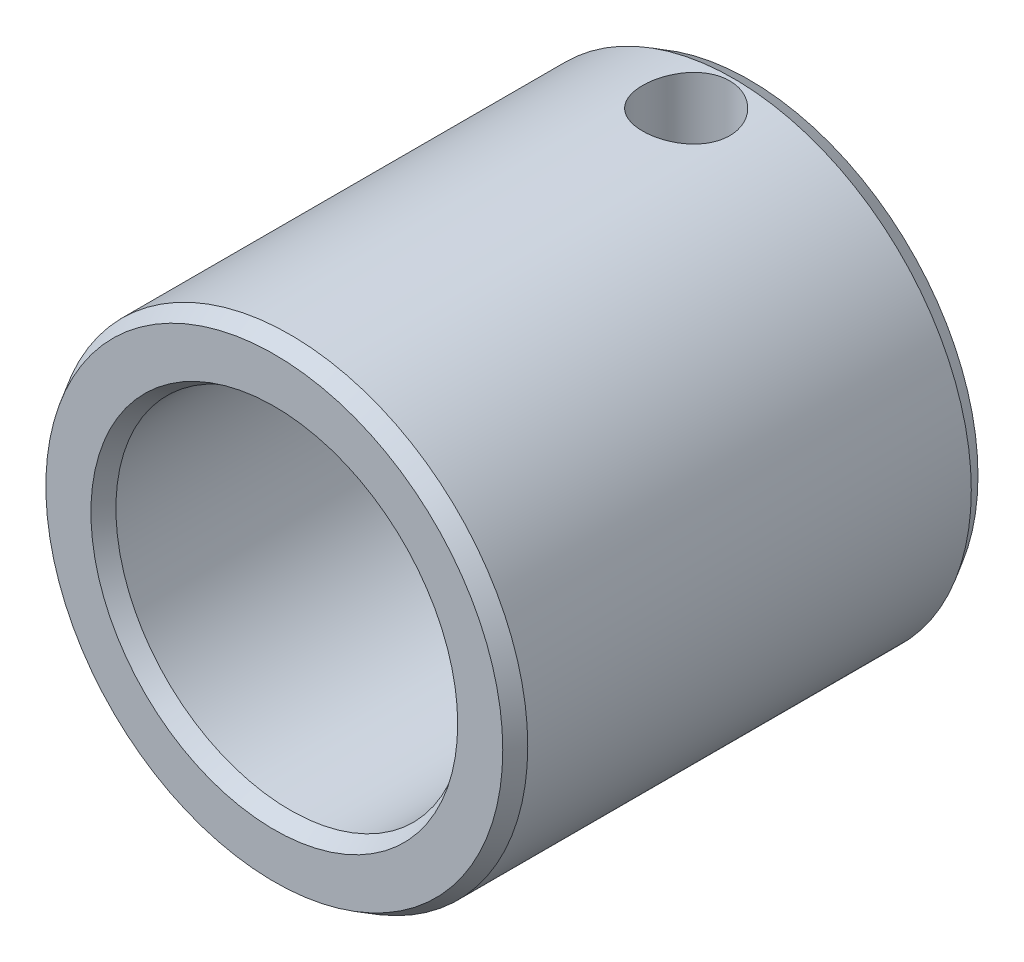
ISO-10303-21;
HEADER;
FILE_DESCRIPTION(('STEP AP214'),'2;1');
FILE_NAME('part.step','',(''),(''),'','','');
FILE_SCHEMA(('AUTOMOTIVE_DESIGN { 1 0 10303 214 1 1 1 1 }'));
ENDSEC;
DATA;
#1=APPLICATION_CONTEXT('core data for automotive mechanical design processes');
#2=APPLICATION_PROTOCOL_DEFINITION('international standard','automotive_design',2000,#1);
#3=PRODUCT_CONTEXT('',#1,'mechanical');
#4=PRODUCT('Part','Part','',(#3));
#5=PRODUCT_RELATED_PRODUCT_CATEGORY('part','',(#4));
#6=PRODUCT_DEFINITION_FORMATION('','',#4);
#7=PRODUCT_DEFINITION_CONTEXT('part definition',#1,'design');
#8=PRODUCT_DEFINITION('design','',#6,#7);
#9=PRODUCT_DEFINITION_SHAPE('','',#8);
#10=(LENGTH_UNIT() NAMED_UNIT(*) SI_UNIT(.MILLI.,.METRE.));
#11=(NAMED_UNIT(*) PLANE_ANGLE_UNIT() SI_UNIT($,.RADIAN.));
#12=(NAMED_UNIT(*) SI_UNIT($,.STERADIAN.) SOLID_ANGLE_UNIT());
#13=UNCERTAINTY_MEASURE_WITH_UNIT(LENGTH_MEASURE(1.E-05),#10,'distance_accuracy_value','');
#14=(GEOMETRIC_REPRESENTATION_CONTEXT(3) GLOBAL_UNCERTAINTY_ASSIGNED_CONTEXT((#13)) GLOBAL_UNIT_ASSIGNED_CONTEXT((#10,
#11,#12)) REPRESENTATION_CONTEXT('',''));
#15=CARTESIAN_POINT('',(0.,0.,0.));
#16=DIRECTION('',(0.,0.,1.));
#17=DIRECTION('',(1.,0.,0.));
#18=AXIS2_PLACEMENT_3D('',#15,#16,#17);
#19=CARTESIAN_POINT('',(0.,0.,36.072301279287));
#20=DIRECTION('',(0.,0.,1.));
#21=DIRECTION('',(1.,0.,0.));
#22=AXIS2_PLACEMENT_3D('',#19,#20,#21);
#23=CYLINDRICAL_SURFACE('',#22,11.);
#24=CARTESIAN_POINT('',(0.,0.,29.));
#25=DIRECTION('',(0.,0.,1.));
#26=DIRECTION('',(1.,0.,0.));
#27=AXIS2_PLACEMENT_3D('',#24,#25,#26);
#28=CIRCLE('',#27,11.);
#29=CARTESIAN_POINT('',(11.,0.,29.));
#30=VERTEX_POINT('',#29);
#31=EDGE_CURVE('E29',#30,#30,#28,.T.);
#32=ORIENTED_EDGE('',*,*,#31,.T.);
#33=EDGE_LOOP('',(#32));
#34=FACE_BOUND('',#33,.T.);
#35=CARTESIAN_POINT('',(0.,0.,1.));
#36=DIRECTION('',(0.,0.,1.));
#37=DIRECTION('',(1.,0.,0.));
#38=AXIS2_PLACEMENT_3D('',#35,#36,#37);
#39=CIRCLE('',#38,11.);
#40=CARTESIAN_POINT('',(11.,0.,1.));
#41=VERTEX_POINT('',#40);
#42=EDGE_CURVE('E34',#41,#41,#39,.T.);
#43=ORIENTED_EDGE('',*,*,#42,.F.);
#44=EDGE_LOOP('',(#43));
#45=FACE_BOUND('',#44,.T.);
#46=CARTESIAN_POINT('',(0.,11.,6.75));
#47=CARTESIAN_POINT('',(0.151939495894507,10.9999974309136,6.74999573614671));
#48=CARTESIAN_POINT('',(0.303926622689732,10.9968205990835,6.73736549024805));
#49=CARTESIAN_POINT('',(0.603544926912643,10.9844554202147,6.68725388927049));
#50=CARTESIAN_POINT('',(0.751173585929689,10.9752636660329,6.64975844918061));
#51=CARTESIAN_POINT('',(1.03770493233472,10.9518864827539,6.55119470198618));
#52=CARTESIAN_POINT('',(1.17661786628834,10.9377070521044,6.49015470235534));
#53=CARTESIAN_POINT('',(1.44223224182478,10.9058646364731,6.34633411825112));
#54=CARTESIAN_POINT('',(1.56893327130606,10.8882015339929,6.26355280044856));
#55=CARTESIAN_POINT('',(1.80913686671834,10.8509025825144,6.07679855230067));
#56=CARTESIAN_POINT('',(1.92235209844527,10.8312362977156,5.97246211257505));
#57=CARTESIAN_POINT('',(2.12987303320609,10.7923497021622,5.74633762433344));
#58=CARTESIAN_POINT('',(2.22417660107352,10.7731294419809,5.62454760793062));
#59=CARTESIAN_POINT('',(2.39254866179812,10.7370042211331,5.36474208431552));
#60=CARTESIAN_POINT('',(2.46629572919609,10.7201378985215,5.226512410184));
#61=CARTESIAN_POINT('',(2.58939433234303,10.6910740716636,4.9391279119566));
#62=CARTESIAN_POINT('',(2.63874976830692,10.6788758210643,4.78997483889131));
#63=CARTESIAN_POINT('',(2.7106838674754,10.6608420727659,4.48813691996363));
#64=CARTESIAN_POINT('',(2.73377915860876,10.6548840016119,4.33558269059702));
#65=CARTESIAN_POINT('',(2.75414658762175,10.6496383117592,4.0286576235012));
#66=CARTESIAN_POINT('',(2.75142292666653,10.6503496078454,3.87428708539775));
#67=CARTESIAN_POINT('',(2.72064196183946,10.6582521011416,3.57207101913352));
#68=CARTESIAN_POINT('',(2.69320029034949,10.6652858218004,3.42415802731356));
#69=CARTESIAN_POINT('',(2.61474434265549,10.6847896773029,3.13510473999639));
#70=CARTESIAN_POINT('',(2.56372838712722,10.697260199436,2.99396492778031));
#71=CARTESIAN_POINT('',(2.43904737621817,10.7263770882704,2.7208136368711));
#72=CARTESIAN_POINT('',(2.36515888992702,10.7430643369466,2.58890868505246));
#73=CARTESIAN_POINT('',(2.1969865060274,10.7787113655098,2.33914903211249));
#74=CARTESIAN_POINT('',(2.10269903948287,10.7976715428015,2.22129679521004));
#75=CARTESIAN_POINT('',(1.89321627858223,10.8363911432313,1.99946003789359));
#76=CARTESIAN_POINT('',(1.77750147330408,10.85615794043,1.89596676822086));
#77=CARTESIAN_POINT('',(1.53012184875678,10.8937760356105,1.70976105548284));
#78=CARTESIAN_POINT('',(1.39845654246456,10.9116272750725,1.62704924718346));
#79=CARTESIAN_POINT('',(1.12221246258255,10.9434917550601,1.48457392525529));
#80=CARTESIAN_POINT('',(0.977590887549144,10.9574916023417,1.42489020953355));
#81=CARTESIAN_POINT('',(0.679939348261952,10.979978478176,1.33081827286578));
#82=CARTESIAN_POINT('',(0.526910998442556,10.9884665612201,1.29642521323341));
#83=CARTESIAN_POINT('',(0.22098994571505,10.9988174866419,1.2546611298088));
#84=CARTESIAN_POINT('',(0.068193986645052,11.0008443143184,1.24662111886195));
#85=CARTESIAN_POINT('',(-0.236560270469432,10.9985114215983,1.25595650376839));
#86=CARTESIAN_POINT('',(-0.388518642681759,10.9941522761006,1.27332961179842));
#87=CARTESIAN_POINT('',(-0.684959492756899,10.9796423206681,1.33244666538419));
#88=CARTESIAN_POINT('',(-0.829519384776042,10.9695782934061,1.37382564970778));
#89=CARTESIAN_POINT('',(-1.10963836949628,10.9447929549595,1.47936298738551));
#90=CARTESIAN_POINT('',(-1.24519655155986,10.9300711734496,1.54352364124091));
#91=CARTESIAN_POINT('',(-1.50612574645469,10.8972106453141,1.69409956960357));
#92=CARTESIAN_POINT('',(-1.63127331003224,10.879015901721,1.7808895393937));
#93=CARTESIAN_POINT('',(-1.86546545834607,10.8413160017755,1.97378149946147));
#94=CARTESIAN_POINT('',(-1.97450725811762,10.8218106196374,2.07988682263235));
#95=CARTESIAN_POINT('',(-2.17614937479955,10.7830975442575,2.31150359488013));
#96=CARTESIAN_POINT('',(-2.26828042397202,10.7639089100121,2.43742745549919));
#97=CARTESIAN_POINT('',(-2.43010305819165,10.7285361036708,2.70334316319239));
#98=CARTESIAN_POINT('',(-2.49979563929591,10.7123517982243,2.84333438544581));
#99=CARTESIAN_POINT('',(-2.61424427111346,10.6849984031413,3.1326604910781));
#100=CARTESIAN_POINT('',(-2.65914806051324,10.6737996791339,3.28193398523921));
#101=CARTESIAN_POINT('',(-2.72313370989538,10.6576569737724,3.58623433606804));
#102=CARTESIAN_POINT('',(-2.74222121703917,10.6527116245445,3.74125992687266));
#103=CARTESIAN_POINT('',(-2.75373741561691,10.6497398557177,4.04788854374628));
#104=CARTESIAN_POINT('',(-2.74691614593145,10.6515187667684,4.19946196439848));
#105=CARTESIAN_POINT('',(-2.70852501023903,10.6613449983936,4.49922379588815));
#106=CARTESIAN_POINT('',(-2.67695564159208,10.669392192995,4.64741227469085));
#107=CARTESIAN_POINT('',(-2.59037408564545,10.6907397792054,4.93538217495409));
#108=CARTESIAN_POINT('',(-2.53550257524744,10.7040086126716,5.07520839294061));
#109=CARTESIAN_POINT('',(-2.40398567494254,10.7343088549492,5.34376986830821));
#110=CARTESIAN_POINT('',(-2.32733726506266,10.7513407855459,5.47250358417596));
#111=CARTESIAN_POINT('',(-2.15209087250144,10.7878032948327,5.71885015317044));
#112=CARTESIAN_POINT('',(-2.05297246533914,10.8072848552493,5.83608530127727));
#113=CARTESIAN_POINT('',(-1.83661384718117,10.8461471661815,6.05250291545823));
#114=CARTESIAN_POINT('',(-1.71936933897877,10.8655278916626,6.15168108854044));
#115=CARTESIAN_POINT('',(-1.46752390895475,10.9024236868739,6.33092073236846));
#116=CARTESIAN_POINT('',(-1.33264710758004,10.9198986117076,6.4106034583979));
#117=CARTESIAN_POINT('',(-1.0509877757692,10.9505902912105,6.54603701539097));
#118=CARTESIAN_POINT('',(-0.904213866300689,10.9638100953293,6.60180499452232));
#119=CARTESIAN_POINT('',(-0.631418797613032,10.9825477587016,6.67954835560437));
#120=CARTESIAN_POINT('',(-0.506696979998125,10.9890473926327,6.70591061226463));
#121=CARTESIAN_POINT('',(-0.254661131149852,10.9977744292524,6.74113756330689));
#122=CARTESIAN_POINT('',(-0.127347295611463,11.0000021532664,6.75000357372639));
#123=CARTESIAN_POINT('',(0.,11.,6.75));
#124=B_SPLINE_CURVE_WITH_KNOTS('',3,(#46,#47,#48,#49,#50,#51,#52,#53,#54,#55,#56,#57,#58,#59,
#60,#61,#62,#63,#64,#65,#66,#67,#68,#69,#70,#71,#72,#73,#74,#75,#76,#77,#78,#79,#80,#81,#82,#83,
#84,#85,#86,#87,#88,#89,#90,#91,#92,#93,#94,#95,#96,#97,#98,#99,#100,#101,#102,#103,#104,#105,
#106,#107,#108,#109,#110,#111,#112,#113,#114,#115,#116,#117,#118,#119,#120,#121,#122,#123),
.UNSPECIFIED.,.T.,.F.,(4,2,2,2,2,2,2,2,2,2,2,2,2,2,2,2,2,2,2,2,2,2,2,2,2,2,2,2,2,2,2,2,2,2,2,2,
2,2,4),(0.,0.455351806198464,0.910961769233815,1.36602565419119,1.82110489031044,
2.28459798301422,2.74814337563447,3.21857520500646,3.68893178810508,4.14986541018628,
4.61072403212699,5.06041244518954,5.51013289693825,5.964393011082,6.41873266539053,
6.88602751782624,7.35333664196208,7.82225086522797,8.29107535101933,8.74790233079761,
9.20468818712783,9.65470503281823,10.1047673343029,10.5628157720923,11.0209433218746,
11.4903160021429,11.9596678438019,12.426191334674,12.8926127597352,13.3456359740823,
13.7986500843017,14.2489673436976,14.6993470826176,15.1614755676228,15.6237137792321,
16.0943234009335,16.5645950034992,16.9462744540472,17.3279251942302),.UNSPECIFIED.);
#125=CARTESIAN_POINT('',(0.,11.,6.75));
#126=VERTEX_POINT('',#125);
#127=EDGE_CURVE('E49',#126,#126,#124,.T.);
#128=ORIENTED_EDGE('',*,*,#127,.T.);
#129=EDGE_LOOP('',(#128));
#130=FACE_BOUND('',#129,.T.);
#131=ADVANCED_FACE('F12',(#34,#45,#130),#23,.F.);
#132=CARTESIAN_POINT('',(0.,0.,36.072301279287));
#133=DIRECTION('',(0.,0.,1.));
#134=DIRECTION('',(1.,0.,0.));
#135=AXIS2_PLACEMENT_3D('',#132,#133,#134);
#136=CYLINDRICAL_SURFACE('',#135,15.);
#137=CARTESIAN_POINT('',(0.,0.,29.));
#138=DIRECTION('',(0.,0.,1.));
#139=DIRECTION('',(1.,0.,0.));
#140=AXIS2_PLACEMENT_3D('',#137,#138,#139);
#141=CIRCLE('',#140,15.);
#142=CARTESIAN_POINT('',(15.,0.,29.));
#143=VERTEX_POINT('',#142);
#144=EDGE_CURVE('E46',#143,#143,#141,.T.);
#145=ORIENTED_EDGE('',*,*,#144,.F.);
#146=EDGE_LOOP('',(#145));
#147=FACE_BOUND('',#146,.T.);
#148=CARTESIAN_POINT('',(0.,0.,1.));
#149=DIRECTION('',(0.,0.,1.));
#150=DIRECTION('',(1.,0.,0.));
#151=AXIS2_PLACEMENT_3D('',#148,#149,#150);
#152=CIRCLE('',#151,15.);
#153=CARTESIAN_POINT('',(15.,0.,1.));
#154=VERTEX_POINT('',#153);
#155=EDGE_CURVE('E43',#154,#154,#152,.T.);
#156=ORIENTED_EDGE('',*,*,#155,.T.);
#157=EDGE_LOOP('',(#156));
#158=FACE_BOUND('',#157,.T.);
#159=CARTESIAN_POINT('',(0.,15.,6.75));
#160=CARTESIAN_POINT('',(-0.153093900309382,14.9999972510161,6.74999408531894));
#161=CARTESIAN_POINT('',(-0.30626547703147,14.9976319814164,6.73717257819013));
#162=CARTESIAN_POINT('',(-0.608296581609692,14.9884243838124,6.68625588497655));
#163=CARTESIAN_POINT('',(-0.757152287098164,14.9815782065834,6.64813896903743));
#164=CARTESIAN_POINT('',(-1.04613957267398,14.9641750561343,6.54783432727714));
#165=CARTESIAN_POINT('',(-1.18627875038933,14.9536213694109,6.48566791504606));
#166=CARTESIAN_POINT('',(-1.45412377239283,14.9299573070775,6.3390885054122));
#167=CARTESIAN_POINT('',(-1.58183070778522,14.9168471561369,6.25467746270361));
#168=CARTESIAN_POINT('',(-1.82266517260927,14.8893503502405,6.06497648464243));
#169=CARTESIAN_POINT('',(-1.93562942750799,14.8749519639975,5.95948094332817));
#170=CARTESIAN_POINT('',(-2.1423598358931,14.846589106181,5.73104795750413));
#171=CARTESIAN_POINT('',(-2.23612464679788,14.8326246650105,5.60810929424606));
#172=CARTESIAN_POINT('',(-2.40246850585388,14.806596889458,5.34713263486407));
#173=CARTESIAN_POINT('',(-2.47488242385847,14.7945486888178,5.20898774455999));
#174=CARTESIAN_POINT('',(-2.59541207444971,14.7738823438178,4.922235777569));
#175=CARTESIAN_POINT('',(-2.64352980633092,14.7652639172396,4.77362956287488));
#176=CARTESIAN_POINT('',(-2.71357916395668,14.7525507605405,4.47191708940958));
#177=CARTESIAN_POINT('',(-2.73579495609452,14.7484069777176,4.31887891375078));
#178=CARTESIAN_POINT('',(-2.75429164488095,14.7449642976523,4.01119549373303));
#179=CARTESIAN_POINT('',(-2.75057476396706,14.7456649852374,3.8565503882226));
#180=CARTESIAN_POINT('',(-2.71754225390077,14.7517873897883,3.55209529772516));
#181=CARTESIAN_POINT('',(-2.68854893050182,14.7571496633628,3.40224897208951));
#182=CARTESIAN_POINT('',(-2.60629376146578,14.7718977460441,3.1095840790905));
#183=CARTESIAN_POINT('',(-2.55303092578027,14.7812837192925,2.96676579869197));
#184=CARTESIAN_POINT('',(-2.42343106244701,14.8030842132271,2.69126347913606));
#185=CARTESIAN_POINT('',(-2.34696312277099,14.8155158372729,2.5586424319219));
#186=CARTESIAN_POINT('',(-2.17321635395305,14.841995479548,2.3079923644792));
#187=CARTESIAN_POINT('',(-2.0759355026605,14.8560436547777,2.18996476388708));
#188=CARTESIAN_POINT('',(-1.86158278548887,14.8844329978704,1.96998902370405));
#189=CARTESIAN_POINT('',(-1.74423505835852,14.8987753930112,1.86830966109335));
#190=CARTESIAN_POINT('',(-1.4940048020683,14.925942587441,1.68604048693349));
#191=CARTESIAN_POINT('',(-1.36112212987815,14.9387673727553,1.6054508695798));
#192=CARTESIAN_POINT('',(-1.08331945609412,14.9614785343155,1.46761241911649));
#193=CARTESIAN_POINT('',(-0.938385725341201,14.9713614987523,1.4103906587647));
#194=CARTESIAN_POINT('',(-0.640742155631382,14.9870489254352,1.32117929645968));
#195=CARTESIAN_POINT('',(-0.488033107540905,14.9928538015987,1.28918713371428));
#196=CARTESIAN_POINT('',(-0.1814870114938,14.999674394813,1.25171517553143));
#197=CARTESIAN_POINT('',(-0.0276964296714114,15.0007566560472,1.24586696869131));
#198=CARTESIAN_POINT('',(0.278665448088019,14.9981935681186,1.25986196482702));
#199=CARTESIAN_POINT('',(0.431236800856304,14.9945484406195,1.27970396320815));
#200=CARTESIAN_POINT('',(0.729667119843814,14.9829815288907,1.34420979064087));
#201=CARTESIAN_POINT('',(0.875567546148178,14.9750917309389,1.38868804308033));
#202=CARTESIAN_POINT('',(1.15784057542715,14.9559164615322,1.501003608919));
#203=CARTESIAN_POINT('',(1.2942125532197,14.9446307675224,1.56884245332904));
#204=CARTESIAN_POINT('',(1.55513574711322,14.9197496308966,1.72677482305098));
#205=CARTESIAN_POINT('',(1.67954783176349,14.9061311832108,1.81709451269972));
#206=CARTESIAN_POINT('',(1.91158174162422,14.8781564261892,2.01711764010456));
#207=CARTESIAN_POINT('',(2.01920207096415,14.8638000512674,2.12682280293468));
#208=CARTESIAN_POINT('',(2.21599031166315,14.8357478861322,2.36416748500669));
#209=CARTESIAN_POINT('',(2.30490730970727,14.8220627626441,2.49201651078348));
#210=CARTESIAN_POINT('',(2.46000320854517,14.7971139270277,2.76105288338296));
#211=CARTESIAN_POINT('',(2.52618293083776,14.7858501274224,2.90223974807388));
#212=CARTESIAN_POINT('',(2.63356582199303,14.7671022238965,3.19329356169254));
#213=CARTESIAN_POINT('',(2.67488605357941,14.7596004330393,3.34311612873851));
#214=CARTESIAN_POINT('',(2.73173972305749,14.7491846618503,3.64772693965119));
#215=CARTESIAN_POINT('',(2.74727592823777,14.746270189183,3.80251464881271));
#216=CARTESIAN_POINT('',(2.75203112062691,14.7453832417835,4.11015028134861));
#217=CARTESIAN_POINT('',(2.74164570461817,14.7473364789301,4.26299201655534));
#218=CARTESIAN_POINT('',(2.69571632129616,14.7558005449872,4.56471215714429));
#219=CARTESIAN_POINT('',(2.66017248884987,14.7623113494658,4.71359058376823));
#220=CARTESIAN_POINT('',(2.56509900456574,14.77912629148,5.00295766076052));
#221=CARTESIAN_POINT('',(2.50561036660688,14.7894239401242,5.14346018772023));
#222=CARTESIAN_POINT('',(2.36437859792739,14.8126571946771,5.41255379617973));
#223=CARTESIAN_POINT('',(2.28263399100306,14.8255929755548,5.54114408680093));
#224=CARTESIAN_POINT('',(2.09782771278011,14.8528765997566,5.78474827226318));
#225=CARTESIAN_POINT('',(1.99447745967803,14.8672420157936,5.89954130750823));
#226=CARTESIAN_POINT('',(1.76999701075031,14.8956330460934,6.11028811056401));
#227=CARTESIAN_POINT('',(1.64886273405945,14.9096585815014,6.20623754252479));
#228=CARTESIAN_POINT('',(1.39101348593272,14.9359299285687,6.37733686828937));
#229=CARTESIAN_POINT('',(1.25417414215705,14.9481594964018,6.45230189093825));
#230=CARTESIAN_POINT('',(0.969665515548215,14.9693025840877,6.57805965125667));
#231=CARTESIAN_POINT('',(0.822006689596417,14.9782192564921,6.62887538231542));
#232=CARTESIAN_POINT('',(0.561569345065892,14.9898870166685,6.69442423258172));
#233=CARTESIAN_POINT('',(0.450325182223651,14.9936582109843,6.71523000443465));
#234=CARTESIAN_POINT('',(0.226068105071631,14.9987156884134,6.74301990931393));
#235=CARTESIAN_POINT('',(0.11305523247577,15.0000020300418,6.75000436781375));
#236=CARTESIAN_POINT('',(0.,15.,6.75));
#237=B_SPLINE_CURVE_WITH_KNOTS('',3,(#159,#160,#161,#162,#163,#164,#165,#166,#167,#168,#169,
#170,#171,#172,#173,#174,#175,#176,#177,#178,#179,#180,#181,#182,#183,#184,#185,#186,#187,#188,
#189,#190,#191,#192,#193,#194,#195,#196,#197,#198,#199,#200,#201,#202,#203,#204,#205,#206,#207,
#208,#209,#210,#211,#212,#213,#214,#215,#216,#217,#218,#219,#220,#221,#222,#223,#224,#225,#226,
#227,#228,#229,#230,#231,#232,#233,#234,#235,#236),.UNSPECIFIED.,.T.,.F.,(4,2,2,2,2,2,2,2,2,2,2,
2,2,2,2,2,2,2,2,2,2,2,2,2,2,2,2,2,2,2,2,2,2,2,2,2,2,2,4),(0.,0.458868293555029,
0.918131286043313,1.3769881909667,1.83580478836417,2.29933541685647,2.76289844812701,
3.229957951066,3.69697901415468,4.15882675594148,4.62063491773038,5.07663918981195,
5.53266206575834,5.99130700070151,6.44999651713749,6.91559042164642,7.38118861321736,
7.84732470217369,8.31341347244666,8.77291314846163,9.23239127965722,9.68845448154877,
10.1445475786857,10.6054289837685,11.0663514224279,11.5331103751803,11.9998524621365,
12.4643791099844,12.9288558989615,13.3862876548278,13.8437169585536,14.3003660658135,
14.757045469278,15.2202665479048,15.6835940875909,16.1508835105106,16.6177271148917,
16.956595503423,17.2954559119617),.UNSPECIFIED.);
#238=CARTESIAN_POINT('',(0.,15.,6.75));
#239=VERTEX_POINT('',#238);
#240=EDGE_CURVE('E16',#239,#239,#237,.T.);
#241=ORIENTED_EDGE('',*,*,#240,.T.);
#242=EDGE_LOOP('',(#241));
#243=FACE_BOUND('',#242,.T.);
#244=ADVANCED_FACE('F63',(#147,#158,#243),#136,.T.);
#245=CARTESIAN_POINT('',(0.,0.,29.));
#246=DIRECTION('',(0.,0.,-1.));
#247=DIRECTION('',(-1.,0.,0.));
#248=AXIS2_PLACEMENT_3D('',#245,#246,#247);
#249=CONICAL_SURFACE('',#248,15.,0.523598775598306);
#250=CARTESIAN_POINT('',(0.,0.,30.));
#251=DIRECTION('',(0.,0.,1.));
#252=DIRECTION('',(1.,0.,0.));
#253=AXIS2_PLACEMENT_3D('',#250,#251,#252);
#254=CIRCLE('',#253,14.4226497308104);
#255=CARTESIAN_POINT('',(14.4226497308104,0.,30.));
#256=VERTEX_POINT('',#255);
#257=EDGE_CURVE('E8',#256,#256,#254,.T.);
#258=ORIENTED_EDGE('',*,*,#257,.F.);
#259=EDGE_LOOP('',(#258));
#260=FACE_BOUND('',#259,.T.);
#261=ORIENTED_EDGE('',*,*,#144,.T.);
#262=EDGE_LOOP('',(#261));
#263=FACE_BOUND('',#262,.T.);
#264=ADVANCED_FACE('F14',(#260,#263),#249,.T.);
#265=CARTESIAN_POINT('',(0.,-11.5773502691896,30.));
#266=DIRECTION('',(0.,0.,1.));
#267=DIRECTION('',(1.,0.,0.));
#268=AXIS2_PLACEMENT_3D('',#265,#266,#267);
#269=PLANE('',#268);
#270=ORIENTED_EDGE('',*,*,#257,.T.);
#271=EDGE_LOOP('',(#270));
#272=FACE_BOUND('',#271,.T.);
#273=CARTESIAN_POINT('',(0.,0.,30.));
#274=DIRECTION('',(0.,0.,1.));
#275=DIRECTION('',(1.,0.,0.));
#276=AXIS2_PLACEMENT_3D('',#273,#274,#275);
#277=CIRCLE('',#276,11.5773502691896);
#278=CARTESIAN_POINT('',(11.5773502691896,0.,30.));
#279=VERTEX_POINT('',#278);
#280=EDGE_CURVE('E25',#279,#279,#277,.T.);
#281=ORIENTED_EDGE('',*,*,#280,.F.);
#282=EDGE_LOOP('',(#281));
#283=FACE_BOUND('',#282,.T.);
#284=ADVANCED_FACE('F84',(#272,#283),#269,.T.);
#285=CARTESIAN_POINT('',(0.,0.,29.));
#286=DIRECTION('',(0.,0.,1.));
#287=DIRECTION('',(1.,0.,0.));
#288=AXIS2_PLACEMENT_3D('',#285,#286,#287);
#289=CONICAL_SURFACE('',#288,11.,0.523598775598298);
#290=ORIENTED_EDGE('',*,*,#280,.T.);
#291=EDGE_LOOP('',(#290));
#292=FACE_BOUND('',#291,.T.);
#293=ORIENTED_EDGE('',*,*,#31,.F.);
#294=EDGE_LOOP('',(#293));
#295=FACE_BOUND('',#294,.T.);
#296=ADVANCED_FACE('F77',(#292,#295),#289,.F.);
#297=CARTESIAN_POINT('',(0.,0.,1.));
#298=DIRECTION('',(0.,0.,-1.));
#299=DIRECTION('',(-1.,0.,0.));
#300=AXIS2_PLACEMENT_3D('',#297,#298,#299);
#301=CONICAL_SURFACE('',#300,11.,0.5235987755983);
#302=CARTESIAN_POINT('',(0.,0.,0.));
#303=DIRECTION('',(0.,0.,1.));
#304=DIRECTION('',(1.,0.,0.));
#305=AXIS2_PLACEMENT_3D('',#302,#303,#304);
#306=CIRCLE('',#305,11.5773502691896);
#307=CARTESIAN_POINT('',(11.5773502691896,0.,0.));
#308=VERTEX_POINT('',#307);
#309=EDGE_CURVE('E37',#308,#308,#306,.T.);
#310=ORIENTED_EDGE('',*,*,#309,.F.);
#311=EDGE_LOOP('',(#310));
#312=FACE_BOUND('',#311,.T.);
#313=ORIENTED_EDGE('',*,*,#42,.T.);
#314=EDGE_LOOP('',(#313));
#315=FACE_BOUND('',#314,.T.);
#316=ADVANCED_FACE('F74',(#312,#315),#301,.F.);
#317=CARTESIAN_POINT('',(0.,-14.4226497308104,0.));
#318=DIRECTION('',(0.,0.,-1.));
#319=DIRECTION('',(-1.,0.,0.));
#320=AXIS2_PLACEMENT_3D('',#317,#318,#319);
#321=PLANE('',#320);
#322=ORIENTED_EDGE('',*,*,#309,.T.);
#323=EDGE_LOOP('',(#322));
#324=FACE_BOUND('',#323,.T.);
#325=CARTESIAN_POINT('',(0.,0.,0.));
#326=DIRECTION('',(0.,0.,1.));
#327=DIRECTION('',(1.,0.,0.));
#328=AXIS2_PLACEMENT_3D('',#325,#326,#327);
#329=CIRCLE('',#328,14.4226497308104);
#330=CARTESIAN_POINT('',(14.4226497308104,0.,0.));
#331=VERTEX_POINT('',#330);
#332=EDGE_CURVE('E40',#331,#331,#329,.T.);
#333=ORIENTED_EDGE('',*,*,#332,.F.);
#334=EDGE_LOOP('',(#333));
#335=FACE_BOUND('',#334,.T.);
#336=ADVANCED_FACE('F71',(#324,#335),#321,.T.);
#337=CARTESIAN_POINT('',(0.,0.,1.));
#338=DIRECTION('',(0.,0.,1.));
#339=DIRECTION('',(1.,0.,0.));
#340=AXIS2_PLACEMENT_3D('',#337,#338,#339);
#341=CONICAL_SURFACE('',#340,15.,0.523598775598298);
#342=ORIENTED_EDGE('',*,*,#332,.T.);
#343=EDGE_LOOP('',(#342));
#344=FACE_BOUND('',#343,.T.);
#345=ORIENTED_EDGE('',*,*,#155,.F.);
#346=EDGE_LOOP('',(#345));
#347=FACE_BOUND('',#346,.T.);
#348=ADVANCED_FACE('F61',(#344,#347),#341,.T.);
#349=CARTESIAN_POINT('',(0.,20.,4.));
#350=DIRECTION('',(0.,-1.,0.));
#351=DIRECTION('',(0.,0.,1.));
#352=AXIS2_PLACEMENT_3D('',#349,#350,#351);
#353=CYLINDRICAL_SURFACE('',#352,2.75);
#354=ORIENTED_EDGE('',*,*,#127,.F.);
#355=EDGE_LOOP('',(#354));
#356=FACE_BOUND('',#355,.T.);
#357=ORIENTED_EDGE('',*,*,#240,.F.);
#358=EDGE_LOOP('',(#357));
#359=FACE_BOUND('',#358,.T.);
#360=ADVANCED_FACE('F58',(#356,#359),#353,.F.);
#361=CLOSED_SHELL('',(#131,#244,#264,#284,#296,#316,#336,#348,#360));
#362=MANIFOLD_SOLID_BREP('B1',#361);
#363=ADVANCED_BREP_SHAPE_REPRESENTATION('',(#18,#362),#14);
#364=SHAPE_DEFINITION_REPRESENTATION(#9,#363);
ENDSEC;
END-ISO-10303-21;
